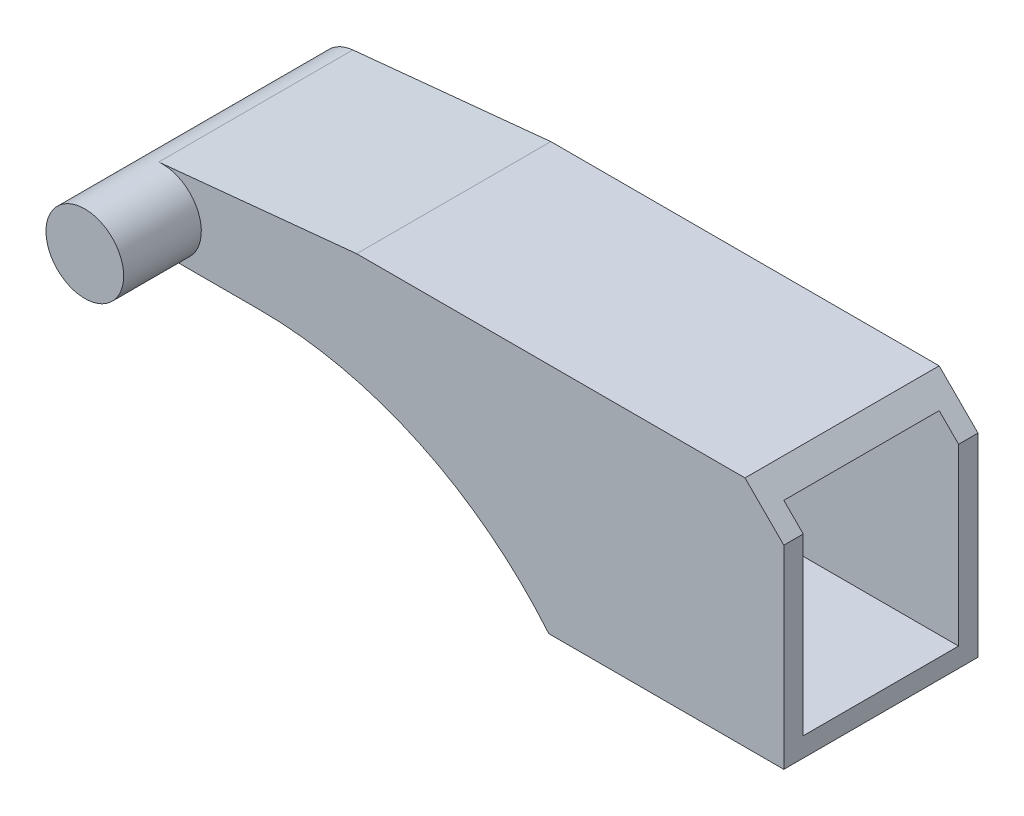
from build123d import *

# Parameters (mm, degrees)
BASE_EXTRUSION_DEPTH    = 5
COQUE1_T                = -0.5
ESQUISSE2_W             = 4
ESQUISSE2_H             = 1.207106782
ENL_V_MAT_EXTRU_1_DEPTH = 2
ESQUISSE3_R             = 1
BOSS_EXTRU_1_DEPTH      = 2
ESQUISSE4_R             = 1.5
BOSS_EXTRU_2_DEPTH      = 0.5


with BuildPart() as part:
    # Esquisse1 → Base-Extrusion (new body)
    with BuildSketch(Plane.XY):
        with BuildLine():
            Line((-16.585786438, 24.585786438), (-17.585786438, 25.585786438))
            Line((-17.585786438, 25.585786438), (-27.585786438, 25.585786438))
            Line((-27.585786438, 25.585786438), (-32.684326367, 25.080919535))
            ThreePointArc((-32.684326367, 25.080919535), (-33.584568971, 24.036456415), (-32.585786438, 23.085786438))
            Line((-32.585786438, 23.085786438), (-30.085786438, 23.085786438))
            ThreePointArc((-30.085786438, 23.085786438), (-25.971428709, 22.167167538), (-22.638521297, 19.585786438))
            Line((-22.638521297, 19.585786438), (-16.585786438, 19.585786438))
            Line((-16.585786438, 19.585786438), (-16.585786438, 24.585786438))
        make_face()
    extrude(amount=BASE_EXTRUSION_DEPTH)

    # Coque1
    coque1_openings = [part.faces().sort_by_distance(p)[0] for p in [
        (-16.585786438, 22.085786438, 2.5),
    ]]
    offset(amount=COQUE1_T, openings=coque1_openings, kind=Kind.INTERSECTION)

    # Esquisse2 → Enl_v. mat.-Extru.1 (cut)
    with BuildSketch(Plane(origin=(-16.585786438, 0, 0), x_dir=(0, 0, -1), z_dir=(1, 0, 0))):
        with Locations((-2.5, 24.482233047)):
            Rectangle(ESQUISSE2_W, ESQUISSE2_H)
    extrude(amount=-ENL_V_MAT_EXTRU_1_DEPTH, mode=Mode.SUBTRACT)

    # Esquisse3 → Boss.-Extru.1 (add)
    with BuildSketch(Plane.XY.offset(5)):
        with Locations(Location((-32.585786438, 24.085786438, 0), (0, 0, 95.655099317))):
            Circle(ESQUISSE3_R)
    extrude(amount=BOSS_EXTRU_1_DEPTH)

    # Esquisse4 → Boss.-Extru.2 (add)
    with BuildSketch(Plane(origin=(0, 0, 0), x_dir=(-1, 0, 0), z_dir=(0, 0, -1))):
        with Locations(Location((19.585786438, 22.585786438, 0), (0, 0, 180))):
            Circle(ESQUISSE4_R)
    extrude(amount=BOSS_EXTRU_2_DEPTH)


solid = part.part
